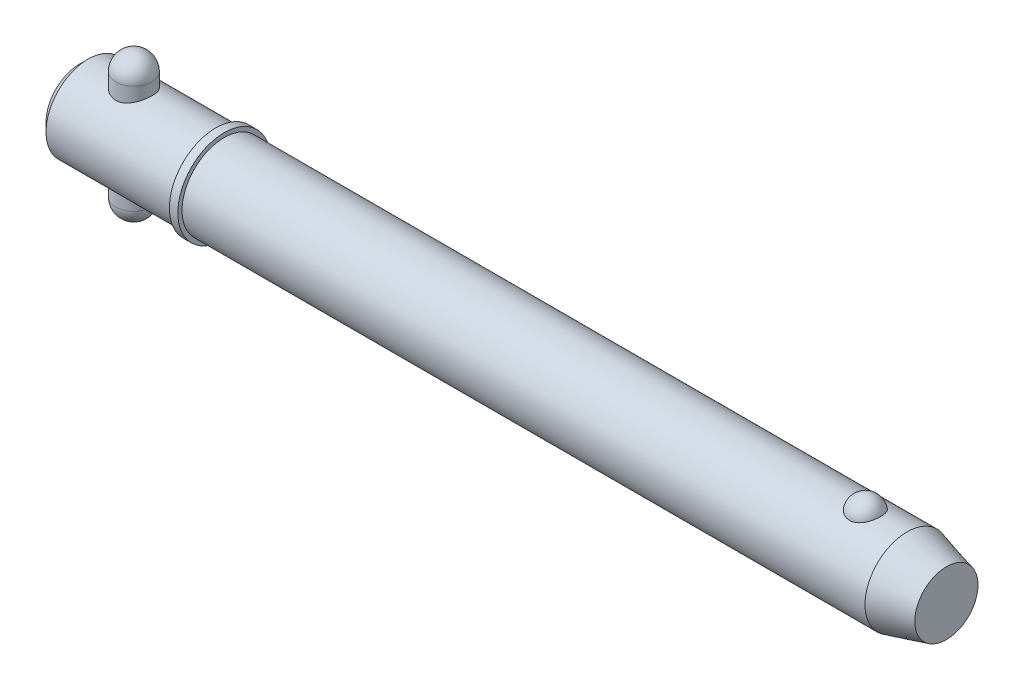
ISO-10303-21;
HEADER;
FILE_DESCRIPTION(('STEP AP214'),'2;1');
FILE_NAME('part.step','',(''),(''),'','','');
FILE_SCHEMA(('AUTOMOTIVE_DESIGN { 1 0 10303 214 1 1 1 1 }'));
ENDSEC;
DATA;
#1=APPLICATION_CONTEXT('core data for automotive mechanical design processes');
#2=APPLICATION_PROTOCOL_DEFINITION('international standard','automotive_design',2000,#1);
#3=PRODUCT_CONTEXT('',#1,'mechanical');
#4=PRODUCT('Part','Part','',(#3));
#5=PRODUCT_RELATED_PRODUCT_CATEGORY('part','',(#4));
#6=PRODUCT_DEFINITION_FORMATION('','',#4);
#7=PRODUCT_DEFINITION_CONTEXT('part definition',#1,'design');
#8=PRODUCT_DEFINITION('design','',#6,#7);
#9=PRODUCT_DEFINITION_SHAPE('','',#8);
#10=(LENGTH_UNIT() NAMED_UNIT(*) SI_UNIT(.MILLI.,.METRE.));
#11=(NAMED_UNIT(*) PLANE_ANGLE_UNIT() SI_UNIT($,.RADIAN.));
#12=(NAMED_UNIT(*) SI_UNIT($,.STERADIAN.) SOLID_ANGLE_UNIT());
#13=UNCERTAINTY_MEASURE_WITH_UNIT(LENGTH_MEASURE(1.E-05),#10,'distance_accuracy_value','');
#14=(GEOMETRIC_REPRESENTATION_CONTEXT(3) GLOBAL_UNCERTAINTY_ASSIGNED_CONTEXT((#13)) GLOBAL_UNIT_ASSIGNED_CONTEXT((#10,
#11,#12)) REPRESENTATION_CONTEXT('',''));
#15=CARTESIAN_POINT('',(0.,0.,0.));
#16=DIRECTION('',(0.,0.,1.));
#17=DIRECTION('',(1.,0.,0.));
#18=AXIS2_PLACEMENT_3D('',#15,#16,#17);
#19=CARTESIAN_POINT('',(14.28,19.05,0.));
#20=DIRECTION('',(0.,-1.,0.));
#21=DIRECTION('',(0.,0.,-1.));
#22=AXIS2_PLACEMENT_3D('',#19,#20,#21);
#23=CYLINDRICAL_SURFACE('',#22,4.76);
#24=CARTESIAN_POINT('',(14.28,-14.29,0.));
#25=DIRECTION('',(0.,-1.,0.));
#26=DIRECTION('',(0.,0.,-1.));
#27=AXIS2_PLACEMENT_3D('',#24,#25,#26);
#28=CIRCLE('',#27,4.76);
#29=CARTESIAN_POINT('',(14.28,-14.29,-4.76));
#30=VERTEX_POINT('',#29);
#31=EDGE_CURVE('P0_E10',#30,#30,#28,.F.);
#32=CARTESIAN_POINT('',(14.28,14.29,0.));
#33=DIRECTION('',(0.,-1.,0.));
#34=DIRECTION('',(0.,0.,-1.));
#35=AXIS2_PLACEMENT_3D('',#32,#33,#34);
#36=CIRCLE('',#35,4.76);
#37=CARTESIAN_POINT('',(14.28,14.29,-4.76));
#38=VERTEX_POINT('',#37);
#39=EDGE_CURVE('P0_E21',#38,#38,#36,.T.);
#40=CARTESIAN_POINT('',(14.28,-14.29,-4.76));
#41=CARTESIAN_POINT('',(14.28,-13.9922916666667,-4.76));
#42=CARTESIAN_POINT('',(14.28,-13.6945833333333,-4.76));
#43=CARTESIAN_POINT('',(14.28,-13.0991666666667,-4.76));
#44=CARTESIAN_POINT('',(14.28,-12.8014583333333,-4.76));
#45=CARTESIAN_POINT('',(14.28,-12.2060416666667,-4.76));
#46=CARTESIAN_POINT('',(14.28,-11.9083333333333,-4.76));
#47=CARTESIAN_POINT('',(14.28,-11.3129166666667,-4.76));
#48=CARTESIAN_POINT('',(14.28,-11.0152083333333,-4.76));
#49=CARTESIAN_POINT('',(14.28,-10.4197916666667,-4.76));
#50=CARTESIAN_POINT('',(14.28,-10.1220833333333,-4.76));
#51=CARTESIAN_POINT('',(14.28,-9.52666666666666,-4.76));
#52=CARTESIAN_POINT('',(14.28,-9.22895833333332,-4.76));
#53=CARTESIAN_POINT('',(14.28,-8.63354166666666,-4.76));
#54=CARTESIAN_POINT('',(14.28,-8.33583333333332,-4.76));
#55=CARTESIAN_POINT('',(14.28,-7.74041666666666,-4.76));
#56=CARTESIAN_POINT('',(14.28,-7.44270833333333,-4.76));
#57=CARTESIAN_POINT('',(14.28,-6.84729166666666,-4.76));
#58=CARTESIAN_POINT('',(14.28,-6.54958333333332,-4.76));
#59=CARTESIAN_POINT('',(14.28,-5.95416666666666,-4.76));
#60=CARTESIAN_POINT('',(14.28,-5.65645833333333,-4.76));
#61=CARTESIAN_POINT('',(14.28,-5.06104166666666,-4.76));
#62=CARTESIAN_POINT('',(14.28,-4.76333333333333,-4.76));
#63=CARTESIAN_POINT('',(14.28,-4.16791666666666,-4.76));
#64=CARTESIAN_POINT('',(14.28,-3.87020833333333,-4.76));
#65=CARTESIAN_POINT('',(14.28,-3.27479166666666,-4.76));
#66=CARTESIAN_POINT('',(14.28,-2.97708333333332,-4.76));
#67=CARTESIAN_POINT('',(14.28,-2.38166666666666,-4.76));
#68=CARTESIAN_POINT('',(14.28,-2.08395833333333,-4.76));
#69=CARTESIAN_POINT('',(14.28,-1.48854166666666,-4.76));
#70=CARTESIAN_POINT('',(14.28,-1.19083333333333,-4.76));
#71=CARTESIAN_POINT('',(14.28,-0.595416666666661,-4.76));
#72=CARTESIAN_POINT('',(14.28,-0.297708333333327,-4.76));
#73=CARTESIAN_POINT('',(14.28,0.297708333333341,-4.76));
#74=CARTESIAN_POINT('',(14.28,0.595416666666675,-4.76));
#75=CARTESIAN_POINT('',(14.28,1.19083333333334,-4.76));
#76=CARTESIAN_POINT('',(14.28,1.48854166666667,-4.76));
#77=CARTESIAN_POINT('',(14.28,2.08395833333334,-4.76));
#78=CARTESIAN_POINT('',(14.28,2.38166666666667,-4.76));
#79=CARTESIAN_POINT('',(14.28,2.97708333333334,-4.76));
#80=CARTESIAN_POINT('',(14.28,3.27479166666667,-4.76));
#81=CARTESIAN_POINT('',(14.28,3.87020833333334,-4.76));
#82=CARTESIAN_POINT('',(14.28,4.16791666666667,-4.76));
#83=CARTESIAN_POINT('',(14.28,4.76333333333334,-4.76));
#84=CARTESIAN_POINT('',(14.28,5.06104166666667,-4.76));
#85=CARTESIAN_POINT('',(14.28,5.65645833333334,-4.76));
#86=CARTESIAN_POINT('',(14.28,5.95416666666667,-4.76));
#87=CARTESIAN_POINT('',(14.28,6.54958333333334,-4.76));
#88=CARTESIAN_POINT('',(14.28,6.84729166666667,-4.76));
#89=CARTESIAN_POINT('',(14.28,7.44270833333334,-4.76));
#90=CARTESIAN_POINT('',(14.28,7.74041666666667,-4.76));
#91=CARTESIAN_POINT('',(14.28,8.33583333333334,-4.76));
#92=CARTESIAN_POINT('',(14.28,8.63354166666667,-4.76));
#93=CARTESIAN_POINT('',(14.28,9.22895833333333,-4.76));
#94=CARTESIAN_POINT('',(14.28,9.52666666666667,-4.76));
#95=CARTESIAN_POINT('',(14.28,10.1220833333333,-4.76));
#96=CARTESIAN_POINT('',(14.28,10.4197916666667,-4.76));
#97=CARTESIAN_POINT('',(14.28,11.0152083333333,-4.76));
#98=CARTESIAN_POINT('',(14.28,11.3129166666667,-4.76));
#99=CARTESIAN_POINT('',(14.28,11.9083333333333,-4.76));
#100=CARTESIAN_POINT('',(14.28,12.2060416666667,-4.76));
#101=CARTESIAN_POINT('',(14.28,12.8014583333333,-4.76));
#102=CARTESIAN_POINT('',(14.28,13.0991666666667,-4.76));
#103=CARTESIAN_POINT('',(14.28,13.6945833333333,-4.76));
#104=CARTESIAN_POINT('',(14.28,13.9922916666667,-4.76));
#105=CARTESIAN_POINT('',(14.28,14.29,-4.76));
#106=B_SPLINE_CURVE_WITH_KNOTS('',3,(#40,#41,#42,#43,#44,#45,#46,#47,#48,#49,#50,#51,#52,#53,
#54,#55,#56,#57,#58,#59,#60,#61,#62,#63,#64,#65,#66,#67,#68,#69,#70,#71,#72,#73,#74,#75,#76,#77,
#78,#79,#80,#81,#82,#83,#84,#85,#86,#87,#88,#89,#90,#91,#92,#93,#94,#95,#96,#97,#98,#99,#100,
#101,#102,#103,#104,#105),.UNSPECIFIED.,.F.,.F.,(4,2,2,2,2,2,2,2,2,2,2,2,2,2,2,2,2,2,2,2,2,2,2,
2,2,2,2,2,2,2,2,2,4),(0.,0.893125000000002,1.78625,2.67937499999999,3.5725,4.465625,5.35875,
6.25187499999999,7.145,8.038125,8.93125,9.82437499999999,10.7175,11.610625,12.50375,13.396875,
14.29,15.183125,16.07625,16.969375,17.8625,18.755625,19.64875,20.541875,21.435,22.328125,
23.22125,24.114375,25.0075,25.900625,26.79375,27.686875,28.58),.UNSPECIFIED.);
#107=EDGE_CURVE('P0_BSEAM14',#30,#38,#106,.T.);
#108=ORIENTED_EDGE('',*,*,#31,.T.);
#109=ORIENTED_EDGE('',*,*,#39,.T.);
#110=ORIENTED_EDGE('',*,*,#107,.T.);
#111=ORIENTED_EDGE('',*,*,#107,.F.);
#112=EDGE_LOOP('',(#108,#110,#109,#111));
#113=FACE_BOUND('',#112,.T.);
#114=ADVANCED_FACE('P0_F14',(#113),#23,.T.);
#115=CARTESIAN_POINT('',(14.28,-14.29,0.));
#116=DIRECTION('',(0.,0.,1.));
#117=DIRECTION('',(1.,0.,0.));
#118=AXIS2_PLACEMENT_3D('',#115,#116,#117);
#119=SPHERICAL_SURFACE('',#118,4.76);
#120=CARTESIAN_POINT('',(14.28,-14.29,0.));
#121=DIRECTION('',(0.,-1.,0.));
#122=DIRECTION('',(0.,0.,-1.));
#123=AXIS2_PLACEMENT_3D('',#120,#121,#122);
#124=SPHERICAL_SURFACE('',#123,4.76);
#125=ORIENTED_EDGE('',*,*,#31,.F.);
#126=EDGE_LOOP('',(#125));
#127=FACE_BOUND('',#126,.T.);
#128=ADVANCED_FACE('P0_F29',(#127),#124,.T.);
#129=CARTESIAN_POINT('',(14.28,14.29,0.));
#130=DIRECTION('',(0.,0.,1.));
#131=DIRECTION('',(1.,0.,0.));
#132=AXIS2_PLACEMENT_3D('',#129,#130,#131);
#133=SPHERICAL_SURFACE('',#132,4.76);
#134=CARTESIAN_POINT('',(14.28,14.29,0.));
#135=DIRECTION('',(0.,-1.,0.));
#136=DIRECTION('',(0.,0.,-1.));
#137=AXIS2_PLACEMENT_3D('',#134,#135,#136);
#138=SPHERICAL_SURFACE('',#137,4.76);
#139=ORIENTED_EDGE('',*,*,#39,.F.);
#140=EDGE_LOOP('',(#139));
#141=FACE_BOUND('',#140,.T.);
#142=ADVANCED_FACE('P0_F16',(#141),#138,.T.);
#143=CLOSED_SHELL('',(#114,#128,#142));
#144=MANIFOLD_SOLID_BREP('P0_B1',#143);
#145=CARTESIAN_POINT('',(0.,0.,0.));
#146=DIRECTION('',(1.,0.,0.));
#147=DIRECTION('',(0.,0.,-1.));
#148=AXIS2_PLACEMENT_3D('',#145,#146,#147);
#149=CYLINDRICAL_SURFACE('',#148,11.115);
#150=CARTESIAN_POINT('',(218.229563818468,0.,0.));
#151=DIRECTION('',(1.,0.,0.));
#152=DIRECTION('',(0.,0.,-1.));
#153=AXIS2_PLACEMENT_3D('',#150,#151,#152);
#154=CIRCLE('',#153,11.115);
#155=CARTESIAN_POINT('',(218.229563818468,0.,-11.115));
#156=VERTEX_POINT('',#155);
#157=EDGE_CURVE('P1_E81',#156,#156,#154,.T.);
#158=ORIENTED_EDGE('',*,*,#157,.F.);
#159=EDGE_LOOP('',(#158));
#160=FACE_BOUND('',#159,.T.);
#161=CARTESIAN_POINT('',(38.1,0.,0.));
#162=DIRECTION('',(1.,0.,0.));
#163=DIRECTION('',(0.,0.,-1.));
#164=AXIS2_PLACEMENT_3D('',#161,#162,#163);
#165=CIRCLE('',#164,11.115);
#166=CARTESIAN_POINT('',(38.1,0.,-11.115));
#167=VERTEX_POINT('',#166);
#168=EDGE_CURVE('P1_E85',#167,#167,#165,.T.);
#169=ORIENTED_EDGE('',*,*,#168,.T.);
#170=EDGE_LOOP('',(#169));
#171=FACE_BOUND('',#170,.T.);
#172=CARTESIAN_POINT('',(207.231068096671,10.3028087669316,4.17077409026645));
#173=CARTESIAN_POINT('',(207.014775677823,10.3028003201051,4.17078240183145));
#174=CARTESIAN_POINT('',(206.798548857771,10.3098895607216,4.15340593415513));
#175=CARTESIAN_POINT('',(206.372540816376,10.3373834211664,4.08449540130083));
#176=CARTESIAN_POINT('',(206.162757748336,10.3577841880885,4.0329712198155));
#177=CARTESIAN_POINT('',(205.755782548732,10.4095237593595,3.89746513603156));
#178=CARTESIAN_POINT('',(205.558572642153,10.4408466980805,3.81353029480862));
#179=CARTESIAN_POINT('',(205.181338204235,10.5110236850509,3.61560339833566));
#180=CARTESIAN_POINT('',(205.001317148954,10.5498792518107,3.50160528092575));
#181=CARTESIAN_POINT('',(204.657684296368,10.6322884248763,3.24292464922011));
#182=CARTESIAN_POINT('',(204.494686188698,10.6759443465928,3.09746040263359));
#183=CARTESIAN_POINT('',(204.194591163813,10.7625291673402,2.7817192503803));
#184=CARTESIAN_POINT('',(204.057499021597,10.8054579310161,2.61143778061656));
#185=CARTESIAN_POINT('',(203.806408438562,10.8881935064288,2.24226695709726));
#186=CARTESIAN_POINT('',(203.693710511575,10.9277761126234,2.04244123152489));
#187=CARTESIAN_POINT('',(203.501777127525,10.997484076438,1.62578254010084));
#188=CARTESIAN_POINT('',(203.422544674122,11.0276085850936,1.40894804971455));
#189=CARTESIAN_POINT('',(203.298303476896,11.0756732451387,0.961250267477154));
#190=CARTESIAN_POINT('',(203.253760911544,11.0934470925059,0.730239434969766));
#191=CARTESIAN_POINT('',(203.201569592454,11.1143331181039,0.263439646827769));
#192=CARTESIAN_POINT('',(203.193920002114,11.1174456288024,0.027650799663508));
#193=CARTESIAN_POINT('',(203.21561056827,11.1087161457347,-0.440729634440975));
#194=CARTESIAN_POINT('',(203.244762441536,11.0969502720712,-0.673331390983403));
#195=CARTESIAN_POINT('',(203.339143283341,11.0597872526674,-1.12996621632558));
#196=CARTESIAN_POINT('',(203.404372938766,11.0343898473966,-1.35399912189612));
#197=CARTESIAN_POINT('',(203.56969844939,10.972515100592,-1.78750286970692));
#198=CARTESIAN_POINT('',(203.66983863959,10.9360236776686,-1.99695478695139));
#199=CARTESIAN_POINT('',(203.902940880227,10.8557595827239,-2.3952066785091));
#200=CARTESIAN_POINT('',(204.035905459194,10.8119863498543,-2.5840050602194));
#201=CARTESIAN_POINT('',(204.332407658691,10.7216733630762,-2.93635726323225));
#202=CARTESIAN_POINT('',(204.496056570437,10.675123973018,-3.09981510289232));
#203=CARTESIAN_POINT('',(204.849860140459,10.5846571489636,-3.39592247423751));
#204=CARTESIAN_POINT('',(205.040012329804,10.5407394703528,-3.52857487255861));
#205=CARTESIAN_POINT('',(205.43750141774,10.4616690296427,-3.75646057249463));
#206=CARTESIAN_POINT('',(205.64436705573,10.4263443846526,-3.85245432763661));
#207=CARTESIAN_POINT('',(206.072954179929,10.3675574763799,-4.00798747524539));
#208=CARTESIAN_POINT('',(206.294670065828,10.344090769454,-4.0675405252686));
#209=CARTESIAN_POINT('',(206.734669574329,10.3128282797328,-4.14614314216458));
#210=CARTESIAN_POINT('',(206.952565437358,10.3043040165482,-4.1670783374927));
#211=CARTESIAN_POINT('',(207.38894951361,10.3016771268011,-4.17357158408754));
#212=CARTESIAN_POINT('',(207.607437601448,10.3075716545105,-4.15913661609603));
#213=CARTESIAN_POINT('',(208.031744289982,10.3326686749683,-4.09636961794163));
#214=CARTESIAN_POINT('',(208.237745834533,10.3514555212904,-4.0490957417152));
#215=CARTESIAN_POINT('',(208.638576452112,10.399818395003,-3.92320197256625));
#216=CARTESIAN_POINT('',(208.8334046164,10.4293952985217,-3.84457953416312));
#217=CARTESIAN_POINT('',(209.211191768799,10.4969600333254,-3.65612410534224));
#218=CARTESIAN_POINT('',(209.393797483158,10.5351178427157,-3.54564545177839));
#219=CARTESIAN_POINT('',(209.738204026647,10.6154999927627,-3.29718036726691));
#220=CARTESIAN_POINT('',(209.900000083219,10.657725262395,-3.15918764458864));
#221=CARTESIAN_POINT('',(210.206959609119,10.744212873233,-2.85163580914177));
#222=CARTESIAN_POINT('',(210.350891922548,10.7884718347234,-2.68084605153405));
#223=CARTESIAN_POINT('',(210.609237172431,10.872374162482,-2.31721864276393));
#224=CARTESIAN_POINT('',(210.723644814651,10.9120167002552,-2.12437704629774));
#225=CARTESIAN_POINT('',(210.923873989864,10.9838919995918,-1.71516999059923));
#226=CARTESIAN_POINT('',(211.00866178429,11.0158465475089,-1.49824866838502));
#227=CARTESIAN_POINT('',(211.14268382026,11.0673523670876,-1.05228572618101));
#228=CARTESIAN_POINT('',(211.191917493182,11.086903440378,-0.823243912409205));
#229=CARTESIAN_POINT('',(211.253891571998,11.1116323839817,-0.359087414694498));
#230=CARTESIAN_POINT('',(211.266566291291,11.1167843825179,-0.123962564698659));
#231=CARTESIAN_POINT('',(211.254973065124,11.1121144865,0.345220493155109));
#232=CARTESIAN_POINT('',(211.230705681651,11.1022928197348,0.579278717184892));
#233=CARTESIAN_POINT('',(211.145907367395,11.0687504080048,1.03866534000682));
#234=CARTESIAN_POINT('',(211.085529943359,11.0450885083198,1.26402641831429));
#235=CARTESIAN_POINT('',(210.929853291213,10.9863185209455,1.70076772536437));
#236=CARTESIAN_POINT('',(210.834551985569,10.9512097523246,1.91214712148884));
#237=CARTESIAN_POINT('',(210.610397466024,10.8729733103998,2.316083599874));
#238=CARTESIAN_POINT('',(210.481380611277,10.8298068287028,2.50854240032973));
#239=CARTESIAN_POINT('',(210.192732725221,10.7401896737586,2.86808766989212));
#240=CARTESIAN_POINT('',(210.033102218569,10.6937390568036,3.03517457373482));
#241=CARTESIAN_POINT('',(209.687534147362,10.6029321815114,3.33857581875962));
#242=CARTESIAN_POINT('',(209.501708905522,10.5585680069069,3.47501541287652));
#243=CARTESIAN_POINT('',(209.107875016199,10.4769321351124,3.71390897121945));
#244=CARTESIAN_POINT('',(208.899863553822,10.439661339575,3.81635861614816));
#245=CARTESIAN_POINT('',(208.454066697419,10.3749407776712,3.98910631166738));
#246=CARTESIAN_POINT('',(208.215234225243,10.3482457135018,4.05700929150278));
#247=CARTESIAN_POINT('',(207.727925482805,10.312188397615,4.14782844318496));
#248=CARTESIAN_POINT('',(207.479453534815,10.3028184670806,4.17076454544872));
#249=CARTESIAN_POINT('',(207.231068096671,10.3028087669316,4.17077409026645));
#250=B_SPLINE_CURVE_WITH_KNOTS('',3,(#172,#173,#174,#175,#176,#177,#178,#179,#180,#181,#182,
#183,#184,#185,#186,#187,#188,#189,#190,#191,#192,#193,#194,#195,#196,#197,#198,#199,#200,#201,
#202,#203,#204,#205,#206,#207,#208,#209,#210,#211,#212,#213,#214,#215,#216,#217,#218,#219,#220,
#221,#222,#223,#224,#225,#226,#227,#228,#229,#230,#231,#232,#233,#234,#235,#236,#237,#238,#239,
#240,#241,#242,#243,#244,#245,#246,#247,#248,#249),.UNSPECIFIED.,.T.,.F.,(4,2,2,2,2,2,2,2,2,2,2,
2,2,2,2,2,2,2,2,2,2,2,2,2,2,2,2,2,2,2,2,2,2,2,2,2,2,2,4),(0.,0.64796614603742,1.29574482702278,
1.9425864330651,2.58955857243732,3.25496465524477,3.92049326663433,4.61566368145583,
5.31089647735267,6.01531821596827,6.71972398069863,7.42054043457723,8.12137023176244,
8.82309331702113,9.5248704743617,10.2292439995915,10.9335519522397,11.6223330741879,
12.3108558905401,12.9647664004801,13.6185478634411,14.252184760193,14.8858731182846,
15.5334360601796,16.1811472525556,16.8611459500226,17.5412664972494,18.2431855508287,
18.9451158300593,19.6483065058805,20.3514864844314,21.0516982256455,21.7519516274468,
22.4556690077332,23.1593743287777,23.860149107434,24.5610129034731,25.3054529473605,
26.049562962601),.UNSPECIFIED.);
#251=CARTESIAN_POINT('',(207.231068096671,10.3028087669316,4.17077409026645));
#252=VERTEX_POINT('',#251);
#253=EDGE_CURVE('P1_E35',#252,#252,#250,.T.);
#254=ORIENTED_EDGE('',*,*,#253,.T.);
#255=EDGE_LOOP('',(#254));
#256=FACE_BOUND('',#255,.T.);
#257=ADVANCED_FACE('P1_F13',(#160,#171,#256),#149,.T.);
#258=CARTESIAN_POINT('',(0.,0.,0.));
#259=DIRECTION('',(-1.,0.,0.));
#260=DIRECTION('',(0.,0.,1.));
#261=AXIS2_PLACEMENT_3D('',#258,#259,#260);
#262=PLANE('',#261);
#263=CARTESIAN_POINT('',(0.,0.,0.));
#264=DIRECTION('',(1.,0.,0.));
#265=DIRECTION('',(0.,0.,-1.));
#266=AXIS2_PLACEMENT_3D('',#263,#264,#265);
#267=CIRCLE('',#266,8.892);
#268=CARTESIAN_POINT('',(0.,0.,-8.892));
#269=VERTEX_POINT('',#268);
#270=EDGE_CURVE('P1_E9',#269,#269,#267,.T.);
#271=ORIENTED_EDGE('',*,*,#270,.F.);
#272=EDGE_LOOP('',(#271));
#273=FACE_BOUND('',#272,.T.);
#274=ADVANCED_FACE('P1_F15',(#273),#262,.T.);
#275=CARTESIAN_POINT('',(2.22299999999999,0.,0.));
#276=DIRECTION('',(1.,0.,0.));
#277=DIRECTION('',(0.,0.,-1.));
#278=AXIS2_PLACEMENT_3D('',#275,#276,#277);
#279=CONICAL_SURFACE('',#278,11.115,0.78539816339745);
#280=ORIENTED_EDGE('',*,*,#270,.T.);
#281=EDGE_LOOP('',(#280));
#282=FACE_BOUND('',#281,.T.);
#283=CARTESIAN_POINT('',(2.22299999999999,0.,0.));
#284=DIRECTION('',(1.,0.,0.));
#285=DIRECTION('',(0.,0.,-1.));
#286=AXIS2_PLACEMENT_3D('',#283,#284,#285);
#287=CIRCLE('',#286,11.115);
#288=CARTESIAN_POINT('',(2.22299999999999,0.,-11.115));
#289=VERTEX_POINT('',#288);
#290=EDGE_CURVE('P1_E26',#289,#289,#287,.T.);
#291=ORIENTED_EDGE('',*,*,#290,.F.);
#292=EDGE_LOOP('',(#291));
#293=FACE_BOUND('',#292,.T.);
#294=ADVANCED_FACE('P1_F77',(#282,#293),#279,.T.);
#295=CARTESIAN_POINT('',(0.,0.,0.));
#296=DIRECTION('',(1.,0.,0.));
#297=DIRECTION('',(0.,0.,-1.));
#298=AXIS2_PLACEMENT_3D('',#295,#296,#297);
#299=CYLINDRICAL_SURFACE('',#298,11.115);
#300=CARTESIAN_POINT('',(14.28,-10.0441836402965,4.76));
#301=CARTESIAN_POINT('',(14.1533731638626,-10.0441846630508,4.75999904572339));
#302=CARTESIAN_POINT('',(14.0267055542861,-10.0465865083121,4.75493985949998));
#303=CARTESIAN_POINT('',(13.774298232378,-10.0561141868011,4.73475585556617));
#304=CARTESIAN_POINT('',(13.6485591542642,-10.0632429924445,4.71962470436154));
#305=CARTESIAN_POINT('',(13.3987500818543,-10.0819979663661,4.67942666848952));
#306=CARTESIAN_POINT('',(13.2746840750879,-10.0936334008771,4.65433930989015));
#307=CARTESIAN_POINT('',(13.0293244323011,-10.1210146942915,4.59449317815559));
#308=CARTESIAN_POINT('',(12.9080319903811,-10.1367622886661,4.55973032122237));
#309=CARTESIAN_POINT('',(12.669614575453,-10.1717810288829,4.48106435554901));
#310=CARTESIAN_POINT('',(12.5524727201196,-10.1910352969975,4.4372048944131));
#311=CARTESIAN_POINT('',(12.3224300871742,-10.2325403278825,4.34063417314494));
#312=CARTESIAN_POINT('',(12.2095309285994,-10.2547922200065,4.28791957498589));
#313=CARTESIAN_POINT('',(11.8782785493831,-10.3250879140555,4.11715127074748));
#314=CARTESIAN_POINT('',(11.6670799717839,-10.3767168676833,3.98637638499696));
#315=CARTESIAN_POINT('',(11.2564039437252,-10.4874309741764,3.68567149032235));
#316=CARTESIAN_POINT('',(11.0583793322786,-10.5467772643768,3.51386978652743));
#317=CARTESIAN_POINT('',(10.6927724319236,-10.6641377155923,3.13969960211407));
#318=CARTESIAN_POINT('',(10.5252022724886,-10.7221513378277,2.93731900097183));
#319=CARTESIAN_POINT('',(10.2965609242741,-10.8050020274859,2.60935726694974));
#320=CARTESIAN_POINT('',(10.2227768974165,-10.8324811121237,2.49310321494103));
#321=CARTESIAN_POINT('',(10.0853380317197,-10.884703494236,2.25418999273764));
#322=CARTESIAN_POINT('',(10.0216789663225,-10.9094479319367,2.13153352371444));
#323=CARTESIAN_POINT('',(9.90506238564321,-10.9554932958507,1.88060370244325));
#324=CARTESIAN_POINT('',(9.85210574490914,-10.9767939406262,1.7523298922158));
#325=CARTESIAN_POINT('',(9.75746464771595,-11.0153112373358,1.49115740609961));
#326=CARTESIAN_POINT('',(9.71577447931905,-11.0325299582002,1.35826111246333));
#327=CARTESIAN_POINT('',(9.64605475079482,-11.0615607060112,1.09614539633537));
#328=CARTESIAN_POINT('',(9.61740732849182,-11.0736151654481,0.96711700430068));
#329=CARTESIAN_POINT('',(9.57092026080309,-11.0932687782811,0.706847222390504));
#330=CARTESIAN_POINT('',(9.55307574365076,-11.1008699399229,0.575606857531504));
#331=CARTESIAN_POINT('',(9.52838640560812,-11.1114054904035,0.31192917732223));
#332=CARTESIAN_POINT('',(9.52153986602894,-11.114340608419,0.179492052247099));
#333=CARTESIAN_POINT('',(9.51892405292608,-11.1154607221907,-0.0855090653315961));
#334=CARTESIAN_POINT('',(9.52315432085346,-11.1136459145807,-0.218073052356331));
#335=CARTESIAN_POINT('',(9.542009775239,-11.1055891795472,-0.473709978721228));
#336=CARTESIAN_POINT('',(9.55594693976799,-11.099640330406,-0.596843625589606));
#337=CARTESIAN_POINT('',(9.59332832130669,-11.0837823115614,-0.841440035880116));
#338=CARTESIAN_POINT('',(9.61677567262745,-11.0738718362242,-0.962902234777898));
#339=CARTESIAN_POINT('',(9.67294089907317,-11.0503378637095,-1.20325684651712));
#340=CARTESIAN_POINT('',(9.70565569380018,-11.0367156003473,-1.32215009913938));
#341=CARTESIAN_POINT('',(9.78005008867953,-11.0060908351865,-1.55666640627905));
#342=CARTESIAN_POINT('',(9.82173311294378,-10.9890870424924,-1.67228819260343));
#343=CARTESIAN_POINT('',(9.96110379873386,-10.9330280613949,-2.01656166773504));
#344=CARTESIAN_POINT('',(10.0722987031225,-10.8892801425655,-2.23915547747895));
#345=CARTESIAN_POINT('',(10.3268588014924,-10.7934745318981,-2.66299199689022));
#346=CARTESIAN_POINT('',(10.4702355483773,-10.7414138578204,-2.86422700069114));
#347=CARTESIAN_POINT('',(10.7973904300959,-10.6296201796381,-3.25557775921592));
#348=CARTESIAN_POINT('',(10.9833705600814,-10.569604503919,-3.443774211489));
#349=CARTESIAN_POINT('',(11.3844486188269,-10.4514707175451,-3.78722133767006));
#350=CARTESIAN_POINT('',(11.5995590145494,-10.3933534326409,-3.94245783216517));
#351=CARTESIAN_POINT('',(11.9444340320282,-10.311516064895,-4.14990014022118));
#352=CARTESIAN_POINT('',(12.0654579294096,-10.2847012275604,-4.21573894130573));
#353=CARTESIAN_POINT('',(12.3132718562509,-10.2342051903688,-4.33688518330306));
#354=CARTESIAN_POINT('',(12.4400593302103,-10.2105226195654,-4.39219723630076));
#355=CARTESIAN_POINT('',(12.6985418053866,-10.1671237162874,-4.49174500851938));
#356=CARTESIAN_POINT('',(12.8302359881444,-10.1474067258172,-4.53598256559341));
#357=CARTESIAN_POINT('',(13.0975061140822,-10.1126841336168,-4.61287629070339));
#358=CARTESIAN_POINT('',(13.233079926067,-10.0976759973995,-4.64553869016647));
#359=CARTESIAN_POINT('',(13.4978553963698,-10.0737863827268,-4.6971059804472));
#360=CARTESIAN_POINT('',(13.6268754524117,-10.0645618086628,-4.716785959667));
#361=CARTESIAN_POINT('',(13.8862990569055,-10.051062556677,-4.74548419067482));
#362=CARTESIAN_POINT('',(14.0167019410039,-10.0467856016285,-4.75450734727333));
#363=CARTESIAN_POINT('',(14.277859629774,-10.0433352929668,-4.76179143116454));
#364=CARTESIAN_POINT('',(14.4086143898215,-10.0441613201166,-4.76005366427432));
#365=CARTESIAN_POINT('',(14.6694025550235,-10.0508838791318,-4.74584231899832));
#366=CARTESIAN_POINT('',(14.7994359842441,-10.0567802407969,-4.73336910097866));
#367=CARTESIAN_POINT('',(15.0487369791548,-10.0728449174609,-4.69907984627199));
#368=CARTESIAN_POINT('',(15.1681238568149,-10.0826872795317,-4.67797462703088));
#369=CARTESIAN_POINT('',(15.4045894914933,-10.1062580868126,-4.62682977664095));
#370=CARTESIAN_POINT('',(15.5216674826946,-10.1199877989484,-4.59678723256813));
#371=CARTESIAN_POINT('',(15.868278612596,-10.1664161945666,-4.49365911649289));
#372=CARTESIAN_POINT('',(16.0933756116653,-10.2043671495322,-4.40754694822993));
#373=CARTESIAN_POINT('',(16.5357981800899,-10.2919879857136,-4.19898201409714));
#374=CARTESIAN_POINT('',(16.7523611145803,-10.3420954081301,-4.07511281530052));
#375=CARTESIAN_POINT('',(17.1627188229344,-10.4477911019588,-3.7959429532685));
#376=CARTESIAN_POINT('',(17.3565033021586,-10.5033818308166,-3.64062816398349));
#377=CARTESIAN_POINT('',(17.7334034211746,-10.6196376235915,-3.28693729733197));
#378=CARTESIAN_POINT('',(17.9141276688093,-10.6803237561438,-3.08599175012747));
#379=CARTESIAN_POINT('',(18.1582189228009,-10.7666348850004,-2.76320365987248));
#380=CARTESIAN_POINT('',(18.2351223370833,-10.7946346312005,-2.65197124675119));
#381=CARTESIAN_POINT('',(18.3793967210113,-10.8483267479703,-2.42297927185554));
#382=CARTESIAN_POINT('',(18.4467718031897,-10.87402011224,-2.30522255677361));
#383=CARTESIAN_POINT('',(18.5717669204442,-10.9225249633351,-2.06324665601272));
#384=CARTESIAN_POINT('',(18.6293326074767,-10.9453202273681,-1.93899615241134));
#385=CARTESIAN_POINT('',(18.73370006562,-10.9872100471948,-1.6855059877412));
#386=CARTESIAN_POINT('',(18.7805065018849,-11.0063062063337,-1.55626851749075));
#387=CARTESIAN_POINT('',(18.8628731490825,-11.0402419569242,-1.29375150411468));
#388=CARTESIAN_POINT('',(18.8984366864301,-11.0550828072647,-1.16047316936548));
#389=CARTESIAN_POINT('',(18.9579183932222,-11.0800638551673,-0.890912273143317));
#390=CARTESIAN_POINT('',(18.9818374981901,-11.0902044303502,-0.75462995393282));
#391=CARTESIAN_POINT('',(19.0164177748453,-11.104911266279,-0.490295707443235));
#392=CARTESIAN_POINT('',(19.027922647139,-11.1098318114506,-0.362373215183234));
#393=CARTESIAN_POINT('',(19.040554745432,-11.1152360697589,-0.105876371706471));
#394=CARTESIAN_POINT('',(19.0416784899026,-11.1157182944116,0.0226981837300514));
#395=CARTESIAN_POINT('',(19.0335275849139,-11.1122291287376,0.27938352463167));
#396=CARTESIAN_POINT('',(19.0242587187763,-11.1082602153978,0.407494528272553));
#397=CARTESIAN_POINT('',(18.9954320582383,-11.0959792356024,0.662388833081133));
#398=CARTESIAN_POINT('',(18.9758704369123,-11.0876655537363,0.789171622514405));
#399=CARTESIAN_POINT('',(18.9276379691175,-11.0673259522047,1.03545890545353));
#400=CARTESIAN_POINT('',(18.8993573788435,-11.0554596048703,1.15505309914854));
#401=CARTESIAN_POINT('',(18.8337694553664,-11.0282166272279,1.39134516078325));
#402=CARTESIAN_POINT('',(18.7964589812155,-11.0128387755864,1.5080420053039));
#403=CARTESIAN_POINT('',(18.671464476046,-10.9619666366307,1.85262797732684));
#404=CARTESIAN_POINT('',(18.5706772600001,-10.9217161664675,2.07521484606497));
#405=CARTESIAN_POINT('',(18.33202463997,-10.8301378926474,2.51061719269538));
#406=CARTESIAN_POINT('',(18.1926775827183,-10.7783885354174,2.72252375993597));
#407=CARTESIAN_POINT('',(17.8829747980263,-10.669863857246,3.12088015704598));
#408=CARTESIAN_POINT('',(17.7126068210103,-10.6130865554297,3.30731987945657));
#409=CARTESIAN_POINT('',(17.3310036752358,-10.495668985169,3.66358491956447));
#410=CARTESIAN_POINT('',(17.1177010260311,-10.4350471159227,3.83122543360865));
#411=CARTESIAN_POINT('',(16.7778915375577,-10.3495418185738,4.05420569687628));
#412=CARTESIAN_POINT('',(16.6612023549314,-10.3219229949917,4.12383380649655));
#413=CARTESIAN_POINT('',(16.4218466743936,-10.2693487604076,4.25306463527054));
#414=CARTESIAN_POINT('',(16.2991829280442,-10.2443921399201,4.31267191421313));
#415=CARTESIAN_POINT('',(16.0488008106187,-10.1979981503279,4.42126071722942));
#416=CARTESIAN_POINT('',(15.9210894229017,-10.1765561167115,4.47025635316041));
#417=CARTESIAN_POINT('',(15.6613937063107,-10.1379191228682,4.55720152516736));
#418=CARTESIAN_POINT('',(15.5294115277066,-10.1207220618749,4.59515652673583));
#419=CARTESIAN_POINT('',(15.2624981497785,-10.091252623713,4.65951684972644));
#420=CARTESIAN_POINT('',(15.1275757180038,-10.0789672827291,4.68595259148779));
#421=CARTESIAN_POINT('',(14.8556442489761,-10.0597530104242,4.72706206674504));
#422=CARTESIAN_POINT('',(14.7186368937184,-10.0528199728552,4.74174481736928));
#423=CARTESIAN_POINT('',(14.5310955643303,-10.047196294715,4.75363843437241));
#424=CARTESIAN_POINT('',(14.48091543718,-10.0460674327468,4.75602323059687));
#425=CARTESIAN_POINT('',(14.3804923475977,-10.044560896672,4.7592042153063));
#426=CARTESIAN_POINT('',(14.3302493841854,-10.0441832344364,4.76000037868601));
#427=CARTESIAN_POINT('',(14.28,-10.0441836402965,4.76));
#428=B_SPLINE_CURVE_WITH_KNOTS('',3,(#300,#301,#302,#303,#304,#305,#306,#307,#308,#309,#310,
#311,#312,#313,#314,#315,#316,#317,#318,#319,#320,#321,#322,#323,#324,#325,#326,#327,#328,#329,
#330,#331,#332,#333,#334,#335,#336,#337,#338,#339,#340,#341,#342,#343,#344,#345,#346,#347,#348,
#349,#350,#351,#352,#353,#354,#355,#356,#357,#358,#359,#360,#361,#362,#363,#364,#365,#366,#367,
#368,#369,#370,#371,#372,#373,#374,#375,#376,#377,#378,#379,#380,#381,#382,#383,#384,#385,#386,
#387,#388,#389,#390,#391,#392,#393,#394,#395,#396,#397,#398,#399,#400,#401,#402,#403,#404,#405,
#406,#407,#408,#409,#410,#411,#412,#413,#414,#415,#416,#417,#418,#419,#420,#421,#422,#423,#424,
#425,#426,#427),.UNSPECIFIED.,.T.,.F.,(4,2,2,2,2,2,2,2,2,2,2,2,2,2,2,2,2,2,2,2,2,2,2,2,2,2,2,2,
2,2,2,2,2,2,2,2,2,2,2,2,2,2,2,2,2,2,2,2,2,2,2,2,2,2,2,2,2,2,2,2,2,2,2,4),(0.,0.379828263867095,
0.759895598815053,1.14074858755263,1.52176256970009,1.90098898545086,2.28035867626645,
3.03818035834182,3.84125131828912,4.6446414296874,5.06541657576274,5.48601561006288,
5.90664899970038,6.3270687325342,6.72470503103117,7.12216187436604,7.51955659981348,
7.91693487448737,8.28868404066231,8.66055582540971,9.03230414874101,9.40419465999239,
10.1585834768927,10.9132435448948,11.7236471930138,12.5343987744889,12.9550196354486,
13.3754557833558,13.7958221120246,14.2159617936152,14.6079540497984,14.9997658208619,
15.3915300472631,15.7832811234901,16.1477615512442,16.512360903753,17.240999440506,
18.0012974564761,18.761937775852,19.5886929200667,20.0025782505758,20.4162843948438,
20.832212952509,21.2479608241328,21.6635855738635,22.0791769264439,22.4642880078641,
22.8495282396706,23.2345541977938,23.6197234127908,23.9896813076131,24.3597680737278,
25.099327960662,25.8726239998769,26.6462260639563,27.4759193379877,27.8914891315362,
28.3068693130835,28.7216936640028,29.1363123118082,29.5498292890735,29.9630287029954,
30.113753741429,30.2644811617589),.UNSPECIFIED.);
#429=CARTESIAN_POINT('',(14.28,-10.0441836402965,4.76));
#430=VERTEX_POINT('',#429);
#431=EDGE_CURVE('P1_E17',#430,#430,#428,.T.);
#432=ORIENTED_EDGE('',*,*,#431,.F.);
#433=EDGE_LOOP('',(#432));
#434=FACE_BOUND('',#433,.T.);
#435=CARTESIAN_POINT('',(14.28,10.0441836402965,4.76));
#436=CARTESIAN_POINT('',(14.4066268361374,10.0441846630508,4.75999904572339));
#437=CARTESIAN_POINT('',(14.5332944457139,10.0465865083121,4.75493985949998));
#438=CARTESIAN_POINT('',(14.785701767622,10.0561141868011,4.73475585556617));
#439=CARTESIAN_POINT('',(14.9114408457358,10.0632429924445,4.71962470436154));
#440=CARTESIAN_POINT('',(15.1612499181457,10.0819979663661,4.67942666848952));
#441=CARTESIAN_POINT('',(15.2853159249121,10.0936334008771,4.65433930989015));
#442=CARTESIAN_POINT('',(15.5306755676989,10.1210146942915,4.59449317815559));
#443=CARTESIAN_POINT('',(15.6519680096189,10.1367622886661,4.55973032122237));
#444=CARTESIAN_POINT('',(15.890385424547,10.1717810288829,4.48106435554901));
#445=CARTESIAN_POINT('',(16.0075272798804,10.1910352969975,4.4372048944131));
#446=CARTESIAN_POINT('',(16.2375699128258,10.2325403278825,4.34063417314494));
#447=CARTESIAN_POINT('',(16.3504690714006,10.2547922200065,4.28791957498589));
#448=CARTESIAN_POINT('',(16.6817214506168,10.3250879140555,4.11715127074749));
#449=CARTESIAN_POINT('',(16.8929200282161,10.3767168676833,3.98637638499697));
#450=CARTESIAN_POINT('',(17.3035960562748,10.4874309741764,3.68567149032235));
#451=CARTESIAN_POINT('',(17.5016206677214,10.5467772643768,3.51386978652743));
#452=CARTESIAN_POINT('',(17.8672275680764,10.6641377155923,3.13969960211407));
#453=CARTESIAN_POINT('',(18.0347977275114,10.7221513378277,2.93731900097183));
#454=CARTESIAN_POINT('',(18.2634390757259,10.8050020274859,2.60935726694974));
#455=CARTESIAN_POINT('',(18.3372231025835,10.8324811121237,2.49310321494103));
#456=CARTESIAN_POINT('',(18.4746619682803,10.884703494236,2.25418999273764));
#457=CARTESIAN_POINT('',(18.5383210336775,10.9094479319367,2.13153352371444));
#458=CARTESIAN_POINT('',(18.6549376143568,10.9554932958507,1.88060370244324));
#459=CARTESIAN_POINT('',(18.7078942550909,10.9767939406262,1.75232989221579));
#460=CARTESIAN_POINT('',(18.8025353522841,11.0153112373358,1.4911574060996));
#461=CARTESIAN_POINT('',(18.844225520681,11.0325299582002,1.35826111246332));
#462=CARTESIAN_POINT('',(18.9139452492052,11.0615607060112,1.09614539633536));
#463=CARTESIAN_POINT('',(18.9425926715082,11.0736151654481,0.967117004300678));
#464=CARTESIAN_POINT('',(18.9890797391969,11.0932687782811,0.706847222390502));
#465=CARTESIAN_POINT('',(19.0069242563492,11.1008699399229,0.575606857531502));
#466=CARTESIAN_POINT('',(19.0316135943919,11.1114054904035,0.311929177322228));
#467=CARTESIAN_POINT('',(19.0384601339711,11.114340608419,0.179492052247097));
#468=CARTESIAN_POINT('',(19.0410759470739,11.1154607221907,-0.0855090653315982));
#469=CARTESIAN_POINT('',(19.0368456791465,11.1136459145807,-0.218073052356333));
#470=CARTESIAN_POINT('',(19.017990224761,11.1055891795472,-0.47370997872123));
#471=CARTESIAN_POINT('',(19.004053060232,11.099640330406,-0.596843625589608));
#472=CARTESIAN_POINT('',(18.9666716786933,11.0837823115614,-0.841440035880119));
#473=CARTESIAN_POINT('',(18.9432243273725,11.0738718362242,-0.9629022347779));
#474=CARTESIAN_POINT('',(18.8870591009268,11.0503378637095,-1.20325684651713));
#475=CARTESIAN_POINT('',(18.8543443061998,11.0367156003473,-1.32215009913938));
#476=CARTESIAN_POINT('',(18.7799499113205,11.0060908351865,-1.55666640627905));
#477=CARTESIAN_POINT('',(18.7382668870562,10.9890870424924,-1.67228819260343));
#478=CARTESIAN_POINT('',(18.5988962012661,10.9330280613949,-2.01656166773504));
#479=CARTESIAN_POINT('',(18.4877012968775,10.8892801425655,-2.23915547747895));
#480=CARTESIAN_POINT('',(18.2331411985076,10.7934745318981,-2.66299199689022));
#481=CARTESIAN_POINT('',(18.0897644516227,10.7414138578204,-2.86422700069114));
#482=CARTESIAN_POINT('',(17.7626095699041,10.6296201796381,-3.25557775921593));
#483=CARTESIAN_POINT('',(17.5766294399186,10.569604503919,-3.443774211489));
#484=CARTESIAN_POINT('',(17.1755513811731,10.4514707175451,-3.78722133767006));
#485=CARTESIAN_POINT('',(16.9604409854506,10.3933534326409,-3.94245783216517));
#486=CARTESIAN_POINT('',(16.6155659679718,10.311516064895,-4.14990014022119));
#487=CARTESIAN_POINT('',(16.4945420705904,10.2847012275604,-4.21573894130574));
#488=CARTESIAN_POINT('',(16.2467281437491,10.2342051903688,-4.33688518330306));
#489=CARTESIAN_POINT('',(16.1199406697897,10.2105226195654,-4.39219723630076));
#490=CARTESIAN_POINT('',(15.8614581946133,10.1671237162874,-4.49174500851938));
#491=CARTESIAN_POINT('',(15.7297640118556,10.1474067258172,-4.53598256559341));
#492=CARTESIAN_POINT('',(15.4624938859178,10.1126841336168,-4.61287629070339));
#493=CARTESIAN_POINT('',(15.326920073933,10.0976759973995,-4.64553869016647));
#494=CARTESIAN_POINT('',(15.0621446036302,10.0737863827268,-4.6971059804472));
#495=CARTESIAN_POINT('',(14.9331245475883,10.0645618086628,-4.716785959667));
#496=CARTESIAN_POINT('',(14.6737009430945,10.051062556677,-4.74548419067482));
#497=CARTESIAN_POINT('',(14.543298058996,10.0467856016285,-4.75450734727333));
#498=CARTESIAN_POINT('',(14.2821403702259,10.0433352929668,-4.76179143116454));
#499=CARTESIAN_POINT('',(14.1513856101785,10.0441613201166,-4.76005366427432));
#500=CARTESIAN_POINT('',(13.8905974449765,10.0508838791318,-4.74584231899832));
#501=CARTESIAN_POINT('',(13.7605640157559,10.0567802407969,-4.73336910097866));
#502=CARTESIAN_POINT('',(13.5112630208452,10.0728449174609,-4.69907984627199));
#503=CARTESIAN_POINT('',(13.3918761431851,10.0826872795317,-4.67797462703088));
#504=CARTESIAN_POINT('',(13.1554105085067,10.1062580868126,-4.62682977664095));
#505=CARTESIAN_POINT('',(13.0383325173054,10.1199877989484,-4.59678723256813));
#506=CARTESIAN_POINT('',(12.691721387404,10.1664161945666,-4.49365911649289));
#507=CARTESIAN_POINT('',(12.4666243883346,10.2043671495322,-4.40754694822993));
#508=CARTESIAN_POINT('',(12.0242018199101,10.2919879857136,-4.19898201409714));
#509=CARTESIAN_POINT('',(11.8076388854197,10.3420954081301,-4.07511281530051));
#510=CARTESIAN_POINT('',(11.3972811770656,10.4477911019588,-3.7959429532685));
#511=CARTESIAN_POINT('',(11.2034966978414,10.5033818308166,-3.64062816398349));
#512=CARTESIAN_POINT('',(10.8265965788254,10.6196376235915,-3.28693729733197));
#513=CARTESIAN_POINT('',(10.6458723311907,10.6803237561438,-3.08599175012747));
#514=CARTESIAN_POINT('',(10.4017810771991,10.7666348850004,-2.76320365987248));
#515=CARTESIAN_POINT('',(10.3248776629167,10.7946346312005,-2.65197124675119));
#516=CARTESIAN_POINT('',(10.1806032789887,10.8483267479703,-2.42297927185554));
#517=CARTESIAN_POINT('',(10.1132281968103,10.87402011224,-2.30522255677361));
#518=CARTESIAN_POINT('',(9.98823307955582,10.9225249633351,-2.06324665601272));
#519=CARTESIAN_POINT('',(9.93066739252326,10.9453202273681,-1.93899615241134));
#520=CARTESIAN_POINT('',(9.82629993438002,10.9872100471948,-1.6855059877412));
#521=CARTESIAN_POINT('',(9.77949349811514,11.0063062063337,-1.55626851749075));
#522=CARTESIAN_POINT('',(9.69712685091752,11.0402419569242,-1.29375150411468));
#523=CARTESIAN_POINT('',(9.66156331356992,11.0550828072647,-1.16047316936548));
#524=CARTESIAN_POINT('',(9.60208160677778,11.0800638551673,-0.890912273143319));
#525=CARTESIAN_POINT('',(9.57816250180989,11.0902044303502,-0.754629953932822));
#526=CARTESIAN_POINT('',(9.54358222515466,11.104911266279,-0.490295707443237));
#527=CARTESIAN_POINT('',(9.53207735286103,11.1098318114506,-0.362373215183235));
#528=CARTESIAN_POINT('',(9.51944525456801,11.1152360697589,-0.105876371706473));
#529=CARTESIAN_POINT('',(9.51832151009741,11.1157182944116,0.0226981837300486));
#530=CARTESIAN_POINT('',(9.52647241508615,11.1122291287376,0.279383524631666));
#531=CARTESIAN_POINT('',(9.53574128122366,11.1082602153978,0.407494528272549));
#532=CARTESIAN_POINT('',(9.5645679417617,11.0959792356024,0.662388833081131));
#533=CARTESIAN_POINT('',(9.58412956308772,11.0876655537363,0.789171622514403));
#534=CARTESIAN_POINT('',(9.63236203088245,11.0673259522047,1.03545890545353));
#535=CARTESIAN_POINT('',(9.66064262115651,11.0554596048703,1.15505309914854));
#536=CARTESIAN_POINT('',(9.72623054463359,11.0282166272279,1.39134516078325));
#537=CARTESIAN_POINT('',(9.76354101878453,11.0128387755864,1.5080420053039));
#538=CARTESIAN_POINT('',(9.88853552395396,10.9619666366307,1.85262797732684));
#539=CARTESIAN_POINT('',(9.98932273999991,10.9217161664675,2.07521484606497));
#540=CARTESIAN_POINT('',(10.22797536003,10.8301378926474,2.51061719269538));
#541=CARTESIAN_POINT('',(10.3673224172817,10.7783885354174,2.72252375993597));
#542=CARTESIAN_POINT('',(10.6770252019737,10.669863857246,3.12088015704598));
#543=CARTESIAN_POINT('',(10.8473931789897,10.6130865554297,3.30731987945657));
#544=CARTESIAN_POINT('',(11.2289963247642,10.495668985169,3.66358491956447));
#545=CARTESIAN_POINT('',(11.4422989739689,10.4350471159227,3.83122543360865));
#546=CARTESIAN_POINT('',(11.7821084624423,10.3495418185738,4.05420569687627));
#547=CARTESIAN_POINT('',(11.8987976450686,10.3219229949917,4.12383380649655));
#548=CARTESIAN_POINT('',(12.1381533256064,10.2693487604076,4.25306463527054));
#549=CARTESIAN_POINT('',(12.2608170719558,10.2443921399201,4.31267191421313));
#550=CARTESIAN_POINT('',(12.5111991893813,10.1979981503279,4.42126071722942));
#551=CARTESIAN_POINT('',(12.6389105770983,10.1765561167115,4.47025635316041));
#552=CARTESIAN_POINT('',(12.8986062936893,10.1379191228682,4.55720152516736));
#553=CARTESIAN_POINT('',(13.0305884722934,10.1207220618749,4.59515652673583));
#554=CARTESIAN_POINT('',(13.2975018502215,10.091252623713,4.65951684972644));
#555=CARTESIAN_POINT('',(13.4324242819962,10.0789672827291,4.68595259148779));
#556=CARTESIAN_POINT('',(13.7043557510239,10.0597530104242,4.72706206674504));
#557=CARTESIAN_POINT('',(13.8413631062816,10.0528199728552,4.74174481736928));
#558=CARTESIAN_POINT('',(14.0289044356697,10.047196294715,4.75363843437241));
#559=CARTESIAN_POINT('',(14.07908456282,10.0460674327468,4.75602323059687));
#560=CARTESIAN_POINT('',(14.1795076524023,10.044560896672,4.7592042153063));
#561=CARTESIAN_POINT('',(14.2297506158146,10.0441832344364,4.76000037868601));
#562=CARTESIAN_POINT('',(14.28,10.0441836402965,4.76));
#563=B_SPLINE_CURVE_WITH_KNOTS('',3,(#435,#436,#437,#438,#439,#440,#441,#442,#443,#444,#445,
#446,#447,#448,#449,#450,#451,#452,#453,#454,#455,#456,#457,#458,#459,#460,#461,#462,#463,#464,
#465,#466,#467,#468,#469,#470,#471,#472,#473,#474,#475,#476,#477,#478,#479,#480,#481,#482,#483,
#484,#485,#486,#487,#488,#489,#490,#491,#492,#493,#494,#495,#496,#497,#498,#499,#500,#501,#502,
#503,#504,#505,#506,#507,#508,#509,#510,#511,#512,#513,#514,#515,#516,#517,#518,#519,#520,#521,
#522,#523,#524,#525,#526,#527,#528,#529,#530,#531,#532,#533,#534,#535,#536,#537,#538,#539,#540,
#541,#542,#543,#544,#545,#546,#547,#548,#549,#550,#551,#552,#553,#554,#555,#556,#557,#558,#559,
#560,#561,#562),.UNSPECIFIED.,.T.,.F.,(4,2,2,2,2,2,2,2,2,2,2,2,2,2,2,2,2,2,2,2,2,2,2,2,2,2,2,2,
2,2,2,2,2,2,2,2,2,2,2,2,2,2,2,2,2,2,2,2,2,2,2,2,2,2,2,2,2,2,2,2,2,2,2,4),(0.,0.379828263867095,
0.759895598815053,1.14074858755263,1.52176256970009,1.90098898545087,2.28035867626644,
3.03818035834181,3.84125131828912,4.6446414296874,5.06541657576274,5.48601561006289,
5.90664899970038,6.3270687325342,6.72470503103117,7.12216187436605,7.51955659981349,
7.91693487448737,8.28868404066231,8.66055582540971,9.03230414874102,9.4041946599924,
10.1585834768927,10.9132435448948,11.7236471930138,12.5343987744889,12.9550196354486,
13.3754557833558,13.7958221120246,14.2159617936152,14.6079540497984,14.9997658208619,
15.3915300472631,15.7832811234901,16.1477615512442,16.512360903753,17.240999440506,
18.0012974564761,18.761937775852,19.5886929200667,20.0025782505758,20.4162843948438,
20.832212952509,21.2479608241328,21.6635855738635,22.0791769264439,22.4642880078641,
22.8495282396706,23.2345541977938,23.6197234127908,23.9896813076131,24.3597680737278,
25.099327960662,25.8726239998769,26.6462260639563,27.4759193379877,27.8914891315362,
28.3068693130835,28.7216936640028,29.1363123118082,29.5498292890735,29.9630287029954,
30.113753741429,30.2644811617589),.UNSPECIFIED.);
#564=CARTESIAN_POINT('',(14.28,10.0441836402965,4.76));
#565=VERTEX_POINT('',#564);
#566=EDGE_CURVE('P1_E43',#565,#565,#563,.T.);
#567=ORIENTED_EDGE('',*,*,#566,.F.);
#568=EDGE_LOOP('',(#567));
#569=FACE_BOUND('',#568,.T.);
#570=ORIENTED_EDGE('',*,*,#290,.T.);
#571=EDGE_LOOP('',(#570));
#572=FACE_BOUND('',#571,.T.);
#573=CARTESIAN_POINT('',(35.877,0.,0.));
#574=DIRECTION('',(1.,0.,0.));
#575=DIRECTION('',(0.,0.,-1.));
#576=AXIS2_PLACEMENT_3D('',#573,#574,#575);
#577=CIRCLE('',#576,11.115);
#578=CARTESIAN_POINT('',(35.877,0.,-11.115));
#579=VERTEX_POINT('',#578);
#580=EDGE_CURVE('P1_E31',#579,#579,#577,.T.);
#581=ORIENTED_EDGE('',*,*,#580,.F.);
#582=EDGE_LOOP('',(#581));
#583=FACE_BOUND('',#582,.T.);
#584=ADVANCED_FACE('P1_F103',(#434,#569,#572,#583),#299,.T.);
#585=CARTESIAN_POINT('',(35.877,11.115,0.));
#586=DIRECTION('',(-1.,0.,0.));
#587=DIRECTION('',(0.,0.,1.));
#588=AXIS2_PLACEMENT_3D('',#585,#586,#587);
#589=PLANE('',#588);
#590=ORIENTED_EDGE('',*,*,#580,.T.);
#591=EDGE_LOOP('',(#590));
#592=FACE_BOUND('',#591,.T.);
#593=CARTESIAN_POINT('',(35.877,0.,0.));
#594=DIRECTION('',(1.,0.,0.));
#595=DIRECTION('',(0.,0.,-1.));
#596=AXIS2_PLACEMENT_3D('',#593,#594,#595);
#597=CIRCLE('',#596,12.2265);
#598=CARTESIAN_POINT('',(35.877,0.,-12.2265));
#599=VERTEX_POINT('',#598);
#600=EDGE_CURVE('P1_E91',#599,#599,#597,.T.);
#601=ORIENTED_EDGE('',*,*,#600,.F.);
#602=EDGE_LOOP('',(#601));
#603=FACE_BOUND('',#602,.T.);
#604=ADVANCED_FACE('P1_F100',(#592,#603),#589,.T.);
#605=CARTESIAN_POINT('',(0.,0.,0.));
#606=DIRECTION('',(1.,0.,0.));
#607=DIRECTION('',(0.,0.,-1.));
#608=AXIS2_PLACEMENT_3D('',#605,#606,#607);
#609=CYLINDRICAL_SURFACE('',#608,12.2265);
#610=ORIENTED_EDGE('',*,*,#600,.T.);
#611=EDGE_LOOP('',(#610));
#612=FACE_BOUND('',#611,.T.);
#613=CARTESIAN_POINT('',(38.1,0.,0.));
#614=DIRECTION('',(1.,0.,0.));
#615=DIRECTION('',(0.,0.,-1.));
#616=AXIS2_PLACEMENT_3D('',#613,#614,#615);
#617=CIRCLE('',#616,12.2265);
#618=CARTESIAN_POINT('',(38.1,0.,-12.2265));
#619=VERTEX_POINT('',#618);
#620=EDGE_CURVE('P1_E88',#619,#619,#617,.T.);
#621=ORIENTED_EDGE('',*,*,#620,.F.);
#622=EDGE_LOOP('',(#621));
#623=FACE_BOUND('',#622,.T.);
#624=ADVANCED_FACE('P1_F68',(#612,#623),#609,.T.);
#625=CARTESIAN_POINT('',(38.1,12.2265,0.));
#626=DIRECTION('',(1.,0.,0.));
#627=DIRECTION('',(0.,0.,-1.));
#628=AXIS2_PLACEMENT_3D('',#625,#626,#627);
#629=PLANE('',#628);
#630=ORIENTED_EDGE('',*,*,#620,.T.);
#631=EDGE_LOOP('',(#630));
#632=FACE_BOUND('',#631,.T.);
#633=ORIENTED_EDGE('',*,*,#168,.F.);
#634=EDGE_LOOP('',(#633));
#635=FACE_BOUND('',#634,.T.);
#636=ADVANCED_FACE('P1_F62',(#632,#635),#629,.T.);
#637=CARTESIAN_POINT('',(228.6,0.,0.));
#638=DIRECTION('',(-1.,0.,0.));
#639=DIRECTION('',(0.,0.,1.));
#640=AXIS2_PLACEMENT_3D('',#637,#638,#639);
#641=CONICAL_SURFACE('',#640,8.33625000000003,0.26179938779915);
#642=ORIENTED_EDGE('',*,*,#157,.T.);
#643=EDGE_LOOP('',(#642));
#644=FACE_BOUND('',#643,.T.);
#645=CARTESIAN_POINT('',(228.6,0.,0.));
#646=DIRECTION('',(1.,0.,0.));
#647=DIRECTION('',(0.,0.,-1.));
#648=AXIS2_PLACEMENT_3D('',#645,#646,#647);
#649=CIRCLE('',#648,8.33625000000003);
#650=CARTESIAN_POINT('',(228.6,0.,-8.33625000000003));
#651=VERTEX_POINT('',#650);
#652=EDGE_CURVE('P1_E42',#651,#651,#649,.T.);
#653=ORIENTED_EDGE('',*,*,#652,.F.);
#654=EDGE_LOOP('',(#653));
#655=FACE_BOUND('',#654,.T.);
#656=ADVANCED_FACE('P1_F59',(#644,#655),#641,.T.);
#657=CARTESIAN_POINT('',(228.6,8.33625000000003,0.));
#658=DIRECTION('',(1.,0.,0.));
#659=DIRECTION('',(0.,0.,-1.));
#660=AXIS2_PLACEMENT_3D('',#657,#658,#659);
#661=PLANE('',#660);
#662=ORIENTED_EDGE('',*,*,#652,.T.);
#663=EDGE_LOOP('',(#662));
#664=FACE_BOUND('',#663,.T.);
#665=ADVANCED_FACE('P1_F55',(#664),#661,.T.);
#666=CARTESIAN_POINT('',(207.231068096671,10.0035,0.));
#667=DIRECTION('',(-1.,0.,0.));
#668=DIRECTION('',(0.,1.,0.));
#669=AXIS2_PLACEMENT_3D('',#666,#667,#668);
#670=SPHERICAL_SURFACE('',#669,4.18150000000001);
#671=ORIENTED_EDGE('',*,*,#253,.F.);
#672=EDGE_LOOP('',(#671));
#673=FACE_BOUND('',#672,.T.);
#674=ADVANCED_FACE('P1_F50',(#673),#670,.T.);
#675=CARTESIAN_POINT('',(14.28,-12.2265,0.));
#676=DIRECTION('',(0.,1.,0.));
#677=DIRECTION('',(0.,0.,1.));
#678=AXIS2_PLACEMENT_3D('',#675,#676,#677);
#679=CYLINDRICAL_SURFACE('',#678,4.76);
#680=ORIENTED_EDGE('',*,*,#431,.T.);
#681=EDGE_LOOP('',(#680));
#682=FACE_BOUND('',#681,.T.);
#683=ORIENTED_EDGE('',*,*,#566,.T.);
#684=EDGE_LOOP('',(#683));
#685=FACE_BOUND('',#684,.T.);
#686=ADVANCED_FACE('P1_F54',(#682,#685),#679,.F.);
#687=CLOSED_SHELL('',(#257,#274,#294,#584,#604,#624,#636,#656,#665,#674,#686));
#688=MANIFOLD_SOLID_BREP('P1_B1',#687);
#689=ADVANCED_BREP_SHAPE_REPRESENTATION('',(#18,#144,#688),#14);
#690=SHAPE_DEFINITION_REPRESENTATION(#9,#689);
ENDSEC;
END-ISO-10303-21;
